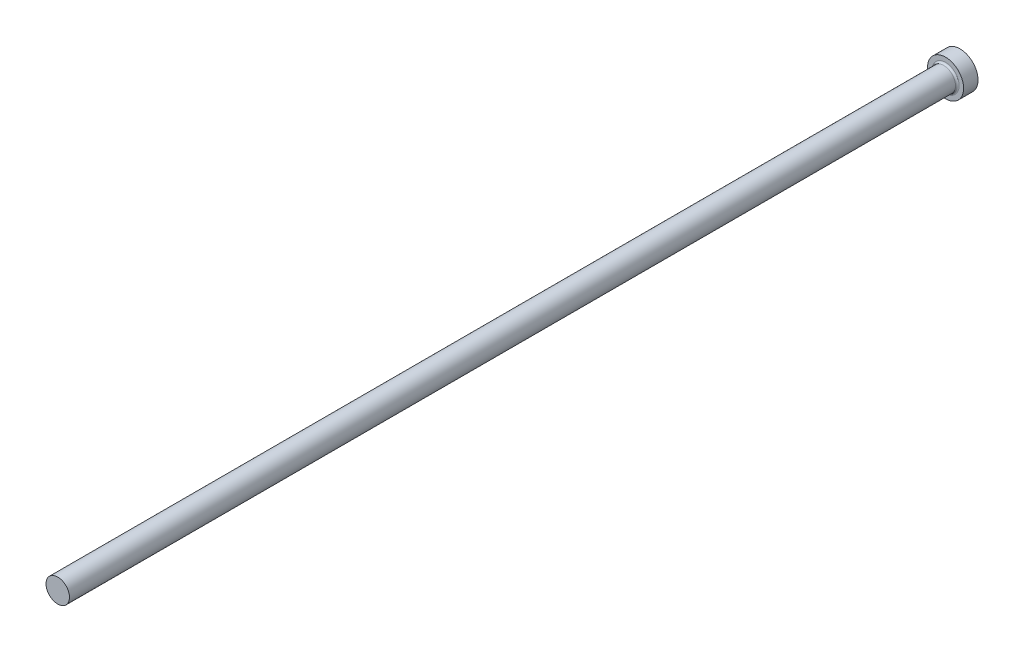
ISO-10303-21;
HEADER;
FILE_DESCRIPTION(('STEP AP214'),'2;1');
FILE_NAME('part.step','',(''),(''),'','','');
FILE_SCHEMA(('AUTOMOTIVE_DESIGN { 1 0 10303 214 1 1 1 1 }'));
ENDSEC;
DATA;
#1=APPLICATION_CONTEXT('core data for automotive mechanical design processes');
#2=APPLICATION_PROTOCOL_DEFINITION('international standard','automotive_design',2000,#1);
#3=PRODUCT_CONTEXT('',#1,'mechanical');
#4=PRODUCT('Part','Part','',(#3));
#5=PRODUCT_RELATED_PRODUCT_CATEGORY('part','',(#4));
#6=PRODUCT_DEFINITION_FORMATION('','',#4);
#7=PRODUCT_DEFINITION_CONTEXT('part definition',#1,'design');
#8=PRODUCT_DEFINITION('design','',#6,#7);
#9=PRODUCT_DEFINITION_SHAPE('','',#8);
#10=(LENGTH_UNIT() NAMED_UNIT(*) SI_UNIT(.MILLI.,.METRE.));
#11=(NAMED_UNIT(*) PLANE_ANGLE_UNIT() SI_UNIT($,.RADIAN.));
#12=(NAMED_UNIT(*) SI_UNIT($,.STERADIAN.) SOLID_ANGLE_UNIT());
#13=UNCERTAINTY_MEASURE_WITH_UNIT(LENGTH_MEASURE(1.E-05),#10,'distance_accuracy_value','');
#14=(GEOMETRIC_REPRESENTATION_CONTEXT(3) GLOBAL_UNCERTAINTY_ASSIGNED_CONTEXT((#13)) GLOBAL_UNIT_ASSIGNED_CONTEXT((#10,
#11,#12)) REPRESENTATION_CONTEXT('',''));
#15=CARTESIAN_POINT('',(0.,0.,0.));
#16=DIRECTION('',(0.,0.,1.));
#17=DIRECTION('',(1.,0.,0.));
#18=AXIS2_PLACEMENT_3D('',#15,#16,#17);
#19=CARTESIAN_POINT('',(5.,0.,4.));
#20=DIRECTION('',(0.,0.,-1.));
#21=DIRECTION('',(-1.,0.,0.));
#22=AXIS2_PLACEMENT_3D('',#19,#20,#21);
#23=PLANE('',#22);
#24=CARTESIAN_POINT('',(0.,0.,4.));
#25=DIRECTION('',(0.,0.,-1.));
#26=DIRECTION('',(-1.,0.,0.));
#27=AXIS2_PLACEMENT_3D('',#24,#25,#26);
#28=CIRCLE('',#27,3.75000000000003);
#29=CARTESIAN_POINT('',(-3.75000000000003,0.,4.));
#30=VERTEX_POINT('',#29);
#31=EDGE_CURVE('E40',#30,#30,#28,.T.);
#32=ORIENTED_EDGE('',*,*,#31,.T.);
#33=EDGE_LOOP('',(#32));
#34=FACE_BOUND('',#33,.T.);
#35=CARTESIAN_POINT('',(0.,0.,4.));
#36=DIRECTION('',(0.,0.,-1.));
#37=DIRECTION('',(-1.,0.,0.));
#38=AXIS2_PLACEMENT_3D('',#35,#36,#37);
#39=CIRCLE('',#38,5.);
#40=CARTESIAN_POINT('',(-5.,0.,4.));
#41=VERTEX_POINT('',#40);
#42=EDGE_CURVE('E44',#41,#41,#39,.T.);
#43=ORIENTED_EDGE('',*,*,#42,.F.);
#44=EDGE_LOOP('',(#43));
#45=FACE_BOUND('',#44,.T.);
#46=ADVANCED_FACE('F33',(#34,#45),#23,.F.);
#47=CARTESIAN_POINT('',(0.,0.,-9.03322817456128));
#48=DIRECTION('',(0.,0.,-1.));
#49=DIRECTION('',(-1.,0.,0.));
#50=AXIS2_PLACEMENT_3D('',#47,#48,#49);
#51=CYLINDRICAL_SURFACE('',#50,5.);
#52=CARTESIAN_POINT('',(0.,0.,0.));
#53=DIRECTION('',(0.,0.,-1.));
#54=DIRECTION('',(-1.,0.,0.));
#55=AXIS2_PLACEMENT_3D('',#52,#53,#54);
#56=CIRCLE('',#55,5.);
#57=CARTESIAN_POINT('',(-5.,0.,0.));
#58=VERTEX_POINT('',#57);
#59=EDGE_CURVE('E48',#58,#58,#56,.T.);
#60=ORIENTED_EDGE('',*,*,#59,.F.);
#61=EDGE_LOOP('',(#60));
#62=FACE_BOUND('',#61,.T.);
#63=ORIENTED_EDGE('',*,*,#42,.T.);
#64=EDGE_LOOP('',(#63));
#65=FACE_BOUND('',#64,.T.);
#66=ADVANCED_FACE('F68',(#62,#65),#51,.T.);
#67=CARTESIAN_POINT('',(0.,0.,0.));
#68=DIRECTION('',(0.,0.,1.));
#69=DIRECTION('',(1.,0.,0.));
#70=AXIS2_PLACEMENT_3D('',#67,#68,#69);
#71=PLANE('',#70);
#72=ORIENTED_EDGE('',*,*,#59,.T.);
#73=EDGE_LOOP('',(#72));
#74=FACE_BOUND('',#73,.T.);
#75=ADVANCED_FACE('F61',(#74),#71,.F.);
#76=CARTESIAN_POINT('',(0.,0.,250.));
#77=DIRECTION('',(0.,0.,-1.));
#78=DIRECTION('',(-1.,0.,0.));
#79=AXIS2_PLACEMENT_3D('',#76,#77,#78);
#80=PLANE('',#79);
#81=CARTESIAN_POINT('',(0.,0.,250.));
#82=DIRECTION('',(0.,0.,-1.));
#83=DIRECTION('',(-1.,0.,0.));
#84=AXIS2_PLACEMENT_3D('',#81,#82,#83);
#85=CIRCLE('',#84,3.25000000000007);
#86=CARTESIAN_POINT('',(-3.25000000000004,0.,250.));
#87=VERTEX_POINT('',#86);
#88=EDGE_CURVE('E53',#87,#87,#85,.T.);
#89=ORIENTED_EDGE('',*,*,#88,.F.);
#90=EDGE_LOOP('',(#89));
#91=FACE_BOUND('',#90,.T.);
#92=ADVANCED_FACE('F59',(#91),#80,.F.);
#93=CARTESIAN_POINT('',(0.,0.,-9.03322817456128));
#94=DIRECTION('',(0.,0.,-1.));
#95=DIRECTION('',(-1.,0.,0.));
#96=AXIS2_PLACEMENT_3D('',#93,#94,#95);
#97=CYLINDRICAL_SURFACE('',#96,3.25000000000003);
#98=CARTESIAN_POINT('',(0.,0.,4.5));
#99=DIRECTION('',(0.,0.,-1.));
#100=DIRECTION('',(-1.,0.,0.));
#101=AXIS2_PLACEMENT_3D('',#98,#99,#100);
#102=CIRCLE('',#101,3.25000000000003);
#103=CARTESIAN_POINT('',(-3.25000000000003,0.,4.5));
#104=VERTEX_POINT('',#103);
#105=EDGE_CURVE('E10',#104,#104,#102,.F.);
#106=ORIENTED_EDGE('',*,*,#105,.T.);
#107=EDGE_LOOP('',(#106));
#108=FACE_BOUND('',#107,.T.);
#109=ORIENTED_EDGE('',*,*,#88,.T.);
#110=EDGE_LOOP('',(#109));
#111=FACE_BOUND('',#110,.T.);
#112=ADVANCED_FACE('F57',(#108,#111),#97,.T.);
#113=CARTESIAN_POINT('',(0.,0.,4.5));
#114=DIRECTION('',(0.,0.,-1.));
#115=DIRECTION('',(-1.,0.,0.));
#116=AXIS2_PLACEMENT_3D('',#113,#114,#115);
#117=TOROIDAL_SURFACE('',#116,3.75000000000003,0.5);
#118=ORIENTED_EDGE('',*,*,#105,.F.);
#119=EDGE_LOOP('',(#118));
#120=FACE_BOUND('',#119,.T.);
#121=ORIENTED_EDGE('',*,*,#31,.F.);
#122=EDGE_LOOP('',(#121));
#123=FACE_BOUND('',#122,.T.);
#124=ADVANCED_FACE('F35',(#120,#123),#117,.F.);
#125=CLOSED_SHELL('',(#46,#66,#75,#92,#112,#124));
#126=MANIFOLD_SOLID_BREP('B2',#125);
#127=ADVANCED_BREP_SHAPE_REPRESENTATION('',(#18,#126),#14);
#128=SHAPE_DEFINITION_REPRESENTATION(#9,#127);
ENDSEC;
END-ISO-10303-21;
